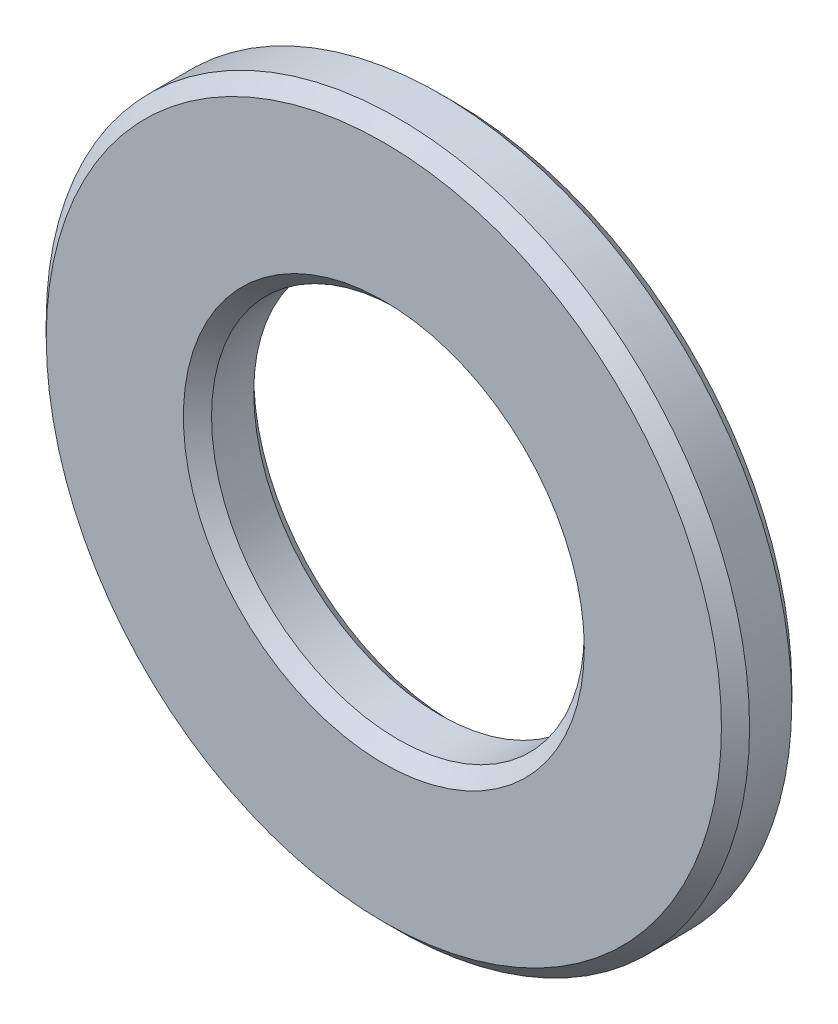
from build123d import *

# Parameters (mm, degrees)
SKETCH1_R           = 5
SKETCH1_R_2         = 2.65
BOSS_EXTRUDE2_DEPTH = 0.5
CHAMFER3_SIZE       = 0.2


with BuildPart() as part:
    # Sketch1 → Boss-Extrude2 (new, symmetric)
    with BuildSketch(Plane.XY):
        Circle(SKETCH1_R)
        Circle(SKETCH1_R_2, mode=Mode.SUBTRACT)
    extrude(amount=BOSS_EXTRUDE2_DEPTH, both=True)

    # Chamfer3
    chamfer3_edges = [part.edges().sort_by_distance(p)[0] for p in [
        (-5, 0, -0.5),
        (-5, 0, 0.5),
        (-2.65, 0, -0.5),
        (-2.65, 0, 0.5),
    ]]
    chamfer(chamfer3_edges, length=CHAMFER3_SIZE)


solid = part.part
